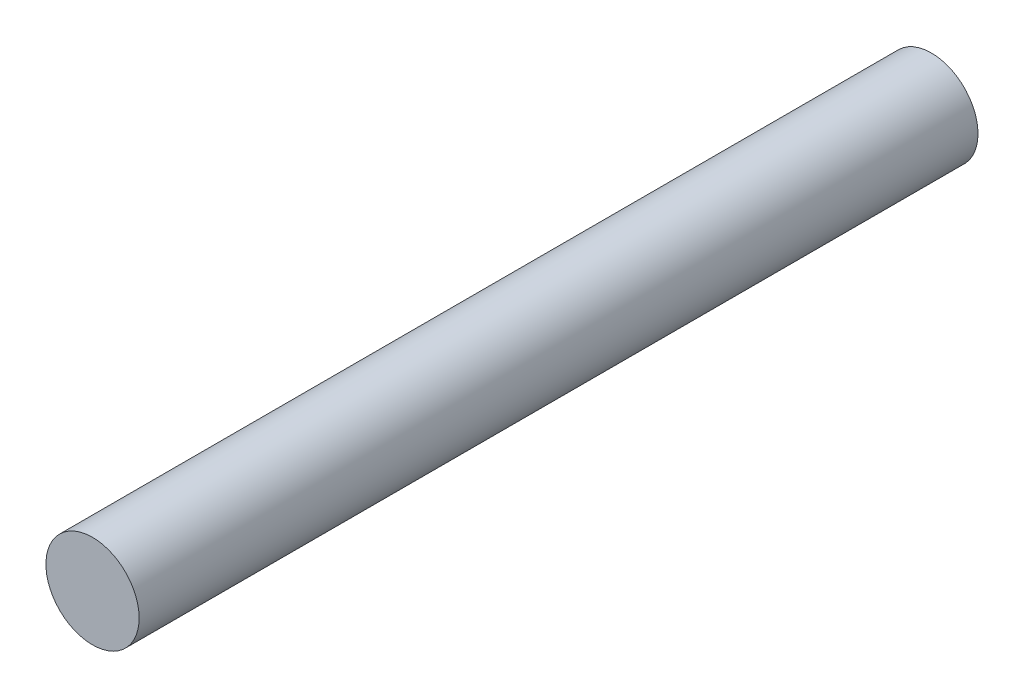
from build123d import *

# Parameters (mm, degrees)
SKETCH1_R           = 3.175
BOSS_EXTRUDE1_DEPTH = 57.15


with BuildPart() as part:
    # Sketch1 → Boss-Extrude1 (new body)
    with BuildSketch(Plane.XY):
        Circle(SKETCH1_R)
    extrude(amount=BOSS_EXTRUDE1_DEPTH)


solid = part.part
